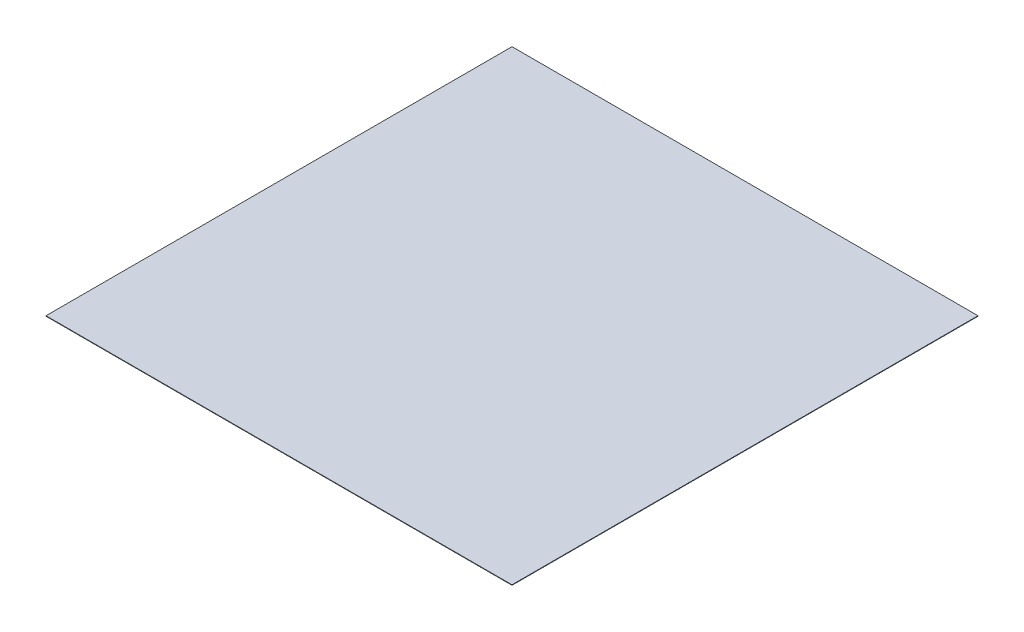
from build123d import *

# Parameters (mm, degrees)
SKETCH1_W      = 25400
SKETCH1_H      = 25400
EXTRUDE1_DEPTH = 25.4


with BuildPart() as part:
    # Sketch1 → Extrude1 (new body)
    with BuildSketch(Plane(origin=(0, 0, 0), x_dir=(1, 0, 0), z_dir=(0, 1, 0))):
        with Locations((12628.777692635, 12639.258989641)):
            Rectangle(SKETCH1_W, SKETCH1_H)
    extrude(amount=EXTRUDE1_DEPTH)


solid = part.part
